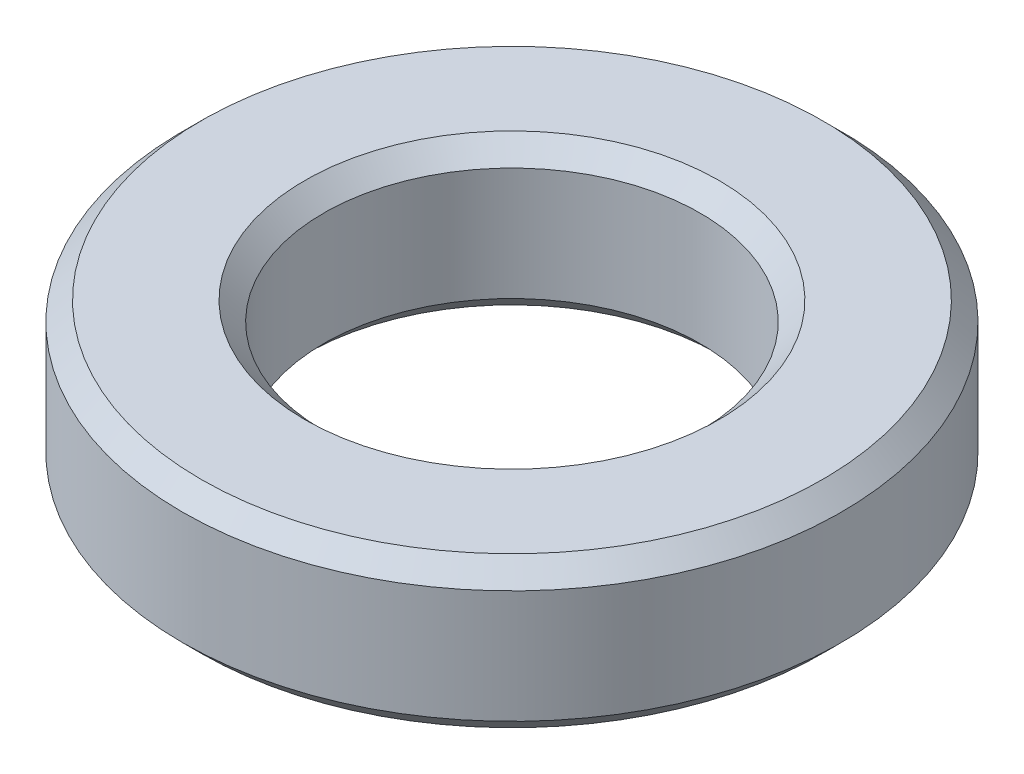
from build123d import *

# Parameters (mm, degrees)
ESQUISSE1_R          = 3.5
ESQUISSE1_R_2        = 2
BASE_EXTRUSION_DEPTH = 1.6
CHANFREIN1_SIZE      = 0.2


with BuildPart() as part:
    # Esquisse1 → Base-Extrusion (new body)
    with BuildSketch(Plane(origin=(0, 0, 0), x_dir=(1, 0, 0), z_dir=(0, 1, 0))):
        with Locations(Location((0, 0, 0), (0, 0, 270))):
            Circle(ESQUISSE1_R)
        with Locations(Location((0, 0, 0), (0, 0, 270))):
            Circle(ESQUISSE1_R_2, mode=Mode.SUBTRACT)
    extrude(amount=BASE_EXTRUSION_DEPTH)

    # Chanfrein1
    chanfrein1_edges = [part.edges().sort_by_distance(p)[0] for p in [
        (0, 0, -3.5),
        (0, 1.6, -3.5),
        (0, 0, -2),
        (0, 1.6, -2),
    ]]
    chamfer(chanfrein1_edges, length=CHANFREIN1_SIZE)


solid = part.part
